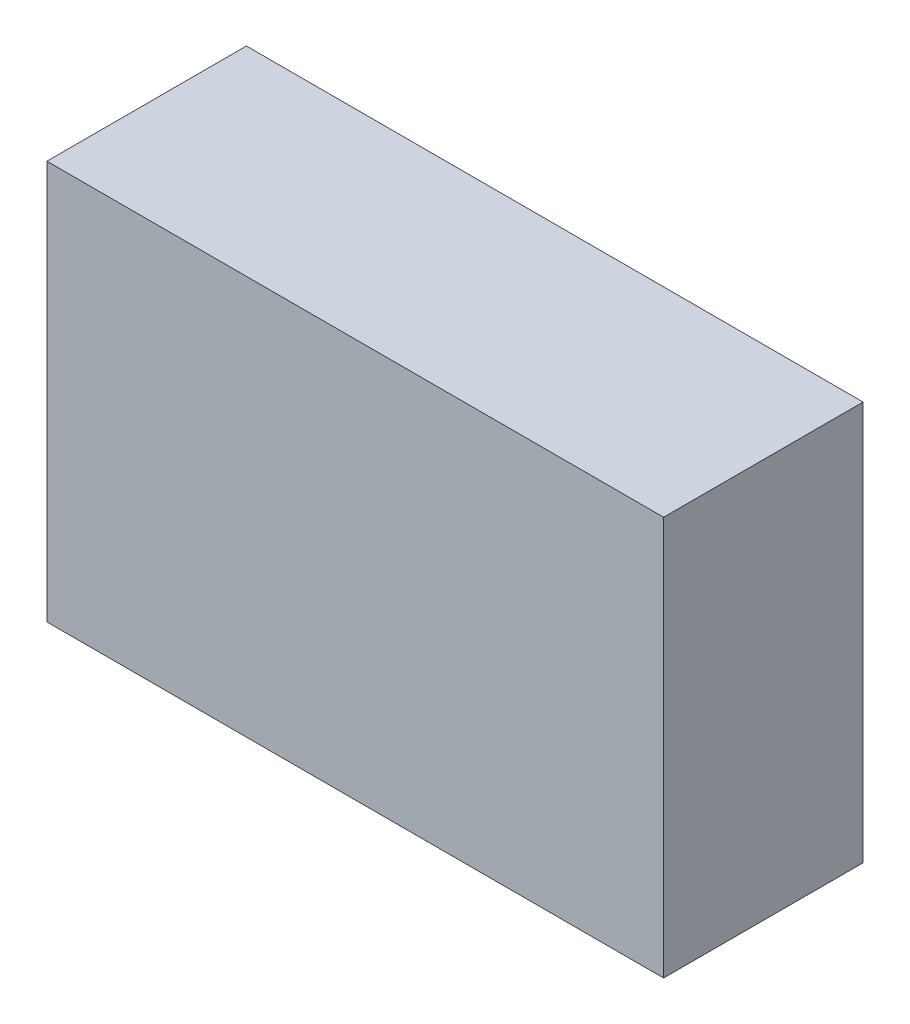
ISO-10303-21;
HEADER;
FILE_DESCRIPTION(('STEP AP214'),'2;1');
FILE_NAME('part.step','',(''),(''),'','','');
FILE_SCHEMA(('AUTOMOTIVE_DESIGN { 1 0 10303 214 1 1 1 1 }'));
ENDSEC;
DATA;
#1=APPLICATION_CONTEXT('core data for automotive mechanical design processes');
#2=APPLICATION_PROTOCOL_DEFINITION('international standard','automotive_design',2000,#1);
#3=PRODUCT_CONTEXT('',#1,'mechanical');
#4=PRODUCT('Part','Part','',(#3));
#5=PRODUCT_RELATED_PRODUCT_CATEGORY('part','',(#4));
#6=PRODUCT_DEFINITION_FORMATION('','',#4);
#7=PRODUCT_DEFINITION_CONTEXT('part definition',#1,'design');
#8=PRODUCT_DEFINITION('design','',#6,#7);
#9=PRODUCT_DEFINITION_SHAPE('','',#8);
#10=(LENGTH_UNIT() NAMED_UNIT(*) SI_UNIT(.MILLI.,.METRE.));
#11=(NAMED_UNIT(*) PLANE_ANGLE_UNIT() SI_UNIT($,.RADIAN.));
#12=(NAMED_UNIT(*) SI_UNIT($,.STERADIAN.) SOLID_ANGLE_UNIT());
#13=UNCERTAINTY_MEASURE_WITH_UNIT(LENGTH_MEASURE(1.E-05),#10,'distance_accuracy_value','');
#14=(GEOMETRIC_REPRESENTATION_CONTEXT(3) GLOBAL_UNCERTAINTY_ASSIGNED_CONTEXT((#13)) GLOBAL_UNIT_ASSIGNED_CONTEXT((#10,
#11,#12)) REPRESENTATION_CONTEXT('',''));
#15=CARTESIAN_POINT('',(0.,0.,0.));
#16=DIRECTION('',(0.,0.,1.));
#17=DIRECTION('',(1.,0.,0.));
#18=AXIS2_PLACEMENT_3D('',#15,#16,#17);
#19=CARTESIAN_POINT('',(0.,0.,0.55));
#20=DIRECTION('',(0.,0.,1.));
#21=DIRECTION('',(1.,0.,0.));
#22=AXIS2_PLACEMENT_3D('',#19,#20,#21);
#23=PLANE('',#22);
#24=DIRECTION('',(0.,1.,0.));
#25=VECTOR('',#24,1.);
#26=CARTESIAN_POINT('',(0.,0.,0.55));
#27=LINE('',#26,#25);
#28=CARTESIAN_POINT('',(0.,0.,0.55));
#29=VERTEX_POINT('',#28);
#30=CARTESIAN_POINT('',(0.,1.1,0.55));
#31=VERTEX_POINT('',#30);
#32=EDGE_CURVE('E90',#29,#31,#27,.T.);
#33=ORIENTED_EDGE('',*,*,#32,.F.);
#34=DIRECTION('',(1.,0.,0.));
#35=VECTOR('',#34,1.);
#36=CARTESIAN_POINT('',(0.,0.,0.55));
#37=LINE('',#36,#35);
#38=CARTESIAN_POINT('',(1.7,0.,0.55));
#39=VERTEX_POINT('',#38);
#40=EDGE_CURVE('E21',#29,#39,#37,.T.);
#41=ORIENTED_EDGE('',*,*,#40,.T.);
#42=DIRECTION('',(0.,1.,0.));
#43=VECTOR('',#42,1.);
#44=CARTESIAN_POINT('',(1.7,0.,0.55));
#45=LINE('',#44,#43);
#46=CARTESIAN_POINT('',(1.7,1.1,0.55));
#47=VERTEX_POINT('',#46);
#48=EDGE_CURVE('E85',#39,#47,#45,.T.);
#49=ORIENTED_EDGE('',*,*,#48,.T.);
#50=DIRECTION('',(1.,0.,0.));
#51=VECTOR('',#50,1.);
#52=CARTESIAN_POINT('',(0.,1.1,0.55));
#53=LINE('',#52,#51);
#54=EDGE_CURVE('E11',#31,#47,#53,.T.);
#55=ORIENTED_EDGE('',*,*,#54,.F.);
#56=EDGE_LOOP('',(#33,#41,#49,#55));
#57=FACE_BOUND('',#56,.T.);
#58=ADVANCED_FACE('F17',(#57),#23,.T.);
#59=CARTESIAN_POINT('',(0.,0.,0.));
#60=DIRECTION('',(0.,0.,1.));
#61=DIRECTION('',(1.,0.,0.));
#62=AXIS2_PLACEMENT_3D('',#59,#60,#61);
#63=PLANE('',#62);
#64=DIRECTION('',(1.,0.,0.));
#65=VECTOR('',#64,1.);
#66=CARTESIAN_POINT('',(0.,1.1,0.));
#67=LINE('',#66,#65);
#68=CARTESIAN_POINT('',(0.,1.1,0.));
#69=VERTEX_POINT('',#68);
#70=CARTESIAN_POINT('',(1.7,1.1,0.));
#71=VERTEX_POINT('',#70);
#72=EDGE_CURVE('E28',#69,#71,#67,.T.);
#73=ORIENTED_EDGE('',*,*,#72,.T.);
#74=DIRECTION('',(0.,1.,0.));
#75=VECTOR('',#74,1.);
#76=CARTESIAN_POINT('',(1.7,0.,0.));
#77=LINE('',#76,#75);
#78=CARTESIAN_POINT('',(1.7,0.,0.));
#79=VERTEX_POINT('',#78);
#80=EDGE_CURVE('E103',#79,#71,#77,.T.);
#81=ORIENTED_EDGE('',*,*,#80,.F.);
#82=DIRECTION('',(1.,0.,0.));
#83=VECTOR('',#82,1.);
#84=CARTESIAN_POINT('',(0.,0.,0.));
#85=LINE('',#84,#83);
#86=CARTESIAN_POINT('',(0.,0.,0.));
#87=VERTEX_POINT('',#86);
#88=EDGE_CURVE('E57',#87,#79,#85,.T.);
#89=ORIENTED_EDGE('',*,*,#88,.F.);
#90=DIRECTION('',(0.,1.,0.));
#91=VECTOR('',#90,1.);
#92=CARTESIAN_POINT('',(0.,0.,0.));
#93=LINE('',#92,#91);
#94=EDGE_CURVE('E91',#87,#69,#93,.T.);
#95=ORIENTED_EDGE('',*,*,#94,.T.);
#96=EDGE_LOOP('',(#73,#81,#89,#95));
#97=FACE_BOUND('',#96,.T.);
#98=ADVANCED_FACE('F123',(#97),#63,.F.);
#99=CARTESIAN_POINT('',(0.,1.1,0.));
#100=DIRECTION('',(0.,1.,0.));
#101=DIRECTION('',(1.,0.,0.));
#102=AXIS2_PLACEMENT_3D('',#99,#100,#101);
#103=PLANE('',#102);
#104=ORIENTED_EDGE('',*,*,#72,.F.);
#105=DIRECTION('',(0.,0.,1.));
#106=VECTOR('',#105,1.);
#107=CARTESIAN_POINT('',(0.,1.1,0.));
#108=LINE('',#107,#106);
#109=EDGE_CURVE('E95',#69,#31,#108,.T.);
#110=ORIENTED_EDGE('',*,*,#109,.T.);
#111=ORIENTED_EDGE('',*,*,#54,.T.);
#112=DIRECTION('',(0.,0.,1.));
#113=VECTOR('',#112,1.);
#114=CARTESIAN_POINT('',(1.7,1.1,0.));
#115=LINE('',#114,#113);
#116=EDGE_CURVE('E107',#71,#47,#115,.T.);
#117=ORIENTED_EDGE('',*,*,#116,.F.);
#118=EDGE_LOOP('',(#104,#110,#111,#117));
#119=FACE_BOUND('',#118,.T.);
#120=ADVANCED_FACE('F19',(#119),#103,.T.);
#121=CARTESIAN_POINT('',(0.,0.,0.));
#122=DIRECTION('',(0.,1.,0.));
#123=DIRECTION('',(1.,0.,0.));
#124=AXIS2_PLACEMENT_3D('',#121,#122,#123);
#125=PLANE('',#124);
#126=DIRECTION('',(0.,0.,1.));
#127=VECTOR('',#126,1.);
#128=CARTESIAN_POINT('',(1.7,0.,0.));
#129=LINE('',#128,#127);
#130=EDGE_CURVE('E80',#79,#39,#129,.T.);
#131=ORIENTED_EDGE('',*,*,#130,.T.);
#132=ORIENTED_EDGE('',*,*,#40,.F.);
#133=DIRECTION('',(0.,0.,1.));
#134=VECTOR('',#133,1.);
#135=CARTESIAN_POINT('',(0.,0.,0.));
#136=LINE('',#135,#134);
#137=EDGE_CURVE('E77',#87,#29,#136,.T.);
#138=ORIENTED_EDGE('',*,*,#137,.F.);
#139=ORIENTED_EDGE('',*,*,#88,.T.);
#140=EDGE_LOOP('',(#131,#132,#138,#139));
#141=FACE_BOUND('',#140,.T.);
#142=ADVANCED_FACE('F76',(#141),#125,.F.);
#143=CARTESIAN_POINT('',(1.7,0.,0.));
#144=DIRECTION('',(1.,0.,0.));
#145=DIRECTION('',(0.,1.,0.));
#146=AXIS2_PLACEMENT_3D('',#143,#144,#145);
#147=PLANE('',#146);
#148=ORIENTED_EDGE('',*,*,#130,.F.);
#149=ORIENTED_EDGE('',*,*,#80,.T.);
#150=ORIENTED_EDGE('',*,*,#116,.T.);
#151=ORIENTED_EDGE('',*,*,#48,.F.);
#152=EDGE_LOOP('',(#148,#149,#150,#151));
#153=FACE_BOUND('',#152,.T.);
#154=ADVANCED_FACE('F121',(#153),#147,.T.);
#155=CARTESIAN_POINT('',(0.,0.,0.));
#156=DIRECTION('',(1.,0.,0.));
#157=DIRECTION('',(0.,1.,0.));
#158=AXIS2_PLACEMENT_3D('',#155,#156,#157);
#159=PLANE('',#158);
#160=ORIENTED_EDGE('',*,*,#32,.T.);
#161=ORIENTED_EDGE('',*,*,#109,.F.);
#162=ORIENTED_EDGE('',*,*,#94,.F.);
#163=ORIENTED_EDGE('',*,*,#137,.T.);
#164=EDGE_LOOP('',(#160,#161,#162,#163));
#165=FACE_BOUND('',#164,.T.);
#166=ADVANCED_FACE('F88',(#165),#159,.F.);
#167=CLOSED_SHELL('',(#58,#98,#120,#142,#154,#166));
#168=MANIFOLD_SOLID_BREP('B1',#167);
#169=ADVANCED_BREP_SHAPE_REPRESENTATION('',(#18,#168),#14);
#170=SHAPE_DEFINITION_REPRESENTATION(#9,#169);
ENDSEC;
END-ISO-10303-21;
